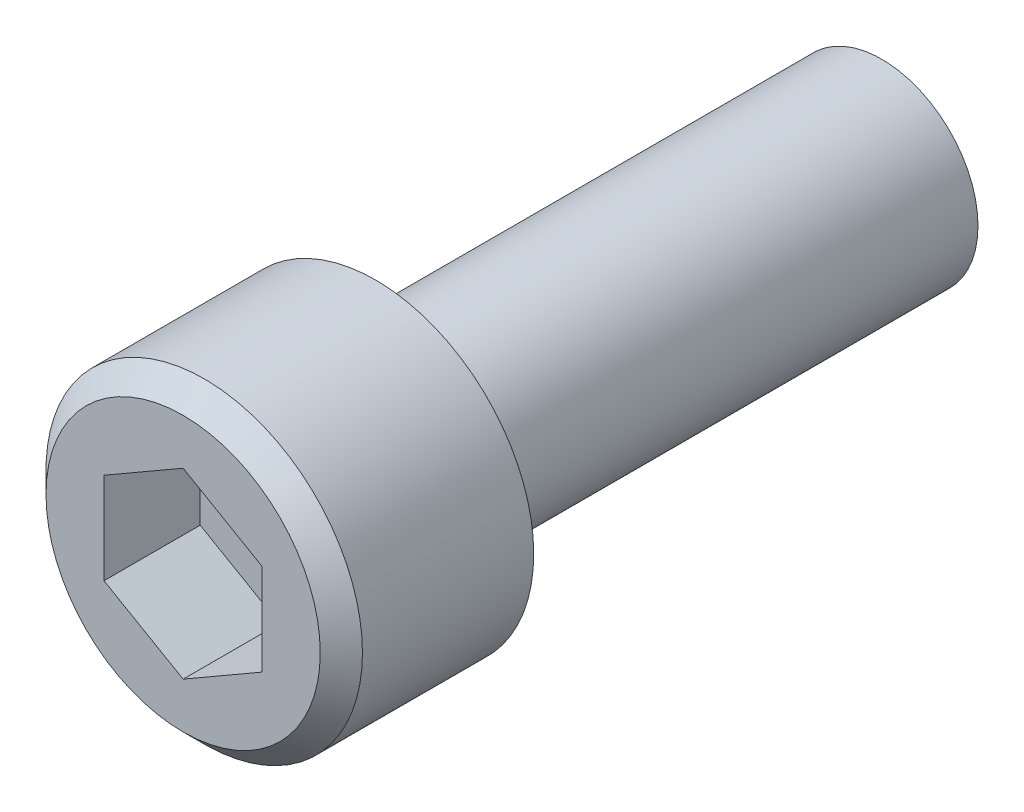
ISO-10303-21;
HEADER;
FILE_DESCRIPTION(('STEP AP214'),'2;1');
FILE_NAME('part.step','',(''),(''),'','','');
FILE_SCHEMA(('AUTOMOTIVE_DESIGN { 1 0 10303 214 1 1 1 1 }'));
ENDSEC;
DATA;
#1=APPLICATION_CONTEXT('core data for automotive mechanical design processes');
#2=APPLICATION_PROTOCOL_DEFINITION('international standard','automotive_design',2000,#1);
#3=PRODUCT_CONTEXT('',#1,'mechanical');
#4=PRODUCT('Part','Part','',(#3));
#5=PRODUCT_RELATED_PRODUCT_CATEGORY('part','',(#4));
#6=PRODUCT_DEFINITION_FORMATION('','',#4);
#7=PRODUCT_DEFINITION_CONTEXT('part definition',#1,'design');
#8=PRODUCT_DEFINITION('design','',#6,#7);
#9=PRODUCT_DEFINITION_SHAPE('','',#8);
#10=(LENGTH_UNIT() NAMED_UNIT(*) SI_UNIT(.MILLI.,.METRE.));
#11=(NAMED_UNIT(*) PLANE_ANGLE_UNIT() SI_UNIT($,.RADIAN.));
#12=(NAMED_UNIT(*) SI_UNIT($,.STERADIAN.) SOLID_ANGLE_UNIT());
#13=UNCERTAINTY_MEASURE_WITH_UNIT(LENGTH_MEASURE(1.E-05),#10,'distance_accuracy_value','');
#14=(GEOMETRIC_REPRESENTATION_CONTEXT(3) GLOBAL_UNCERTAINTY_ASSIGNED_CONTEXT((#13)) GLOBAL_UNIT_ASSIGNED_CONTEXT((#10,
#11,#12)) REPRESENTATION_CONTEXT('',''));
#15=CARTESIAN_POINT('',(0.,0.,0.));
#16=DIRECTION('',(0.,0.,1.));
#17=DIRECTION('',(1.,0.,0.));
#18=AXIS2_PLACEMENT_3D('',#15,#16,#17);
#19=CARTESIAN_POINT('',(0.,0.,12.7));
#20=DIRECTION('',(0.,0.,-1.));
#21=DIRECTION('',(-1.,0.,0.));
#22=AXIS2_PLACEMENT_3D('',#19,#20,#21);
#23=CYLINDRICAL_SURFACE('',#22,2.413);
#24=CARTESIAN_POINT('',(0.,0.,12.3444));
#25=DIRECTION('',(0.,0.,1.));
#26=DIRECTION('',(1.,0.,0.));
#27=AXIS2_PLACEMENT_3D('',#24,#25,#26);
#28=CIRCLE('',#27,2.413);
#29=CARTESIAN_POINT('',(2.413,0.,12.3444));
#30=VERTEX_POINT('',#29);
#31=EDGE_CURVE('E149',#30,#30,#28,.F.);
#32=ORIENTED_EDGE('',*,*,#31,.T.);
#33=EDGE_LOOP('',(#32));
#34=FACE_BOUND('',#33,.T.);
#35=CARTESIAN_POINT('',(0.,0.,0.));
#36=DIRECTION('',(0.,0.,1.));
#37=DIRECTION('',(1.,0.,0.));
#38=AXIS2_PLACEMENT_3D('',#35,#36,#37);
#39=CIRCLE('',#38,2.413);
#40=CARTESIAN_POINT('',(2.413,0.,0.));
#41=VERTEX_POINT('',#40);
#42=EDGE_CURVE('E143',#41,#41,#39,.T.);
#43=ORIENTED_EDGE('',*,*,#42,.T.);
#44=EDGE_LOOP('',(#43));
#45=FACE_BOUND('',#44,.T.);
#46=ADVANCED_FACE('F36',(#34,#45),#23,.T.);
#47=CARTESIAN_POINT('',(0.,0.,0.));
#48=DIRECTION('',(0.,0.,1.));
#49=DIRECTION('',(1.,0.,0.));
#50=AXIS2_PLACEMENT_3D('',#47,#48,#49);
#51=PLANE('',#50);
#52=ORIENTED_EDGE('',*,*,#42,.F.);
#53=EDGE_LOOP('',(#52));
#54=FACE_BOUND('',#53,.T.);
#55=ADVANCED_FACE('F167',(#54),#51,.F.);
#56=CARTESIAN_POINT('',(0.,0.,12.7));
#57=DIRECTION('',(0.,0.,1.));
#58=DIRECTION('',(1.,0.,0.));
#59=AXIS2_PLACEMENT_3D('',#56,#57,#58);
#60=PLANE('',#59);
#61=CARTESIAN_POINT('',(0.,0.,12.7));
#62=DIRECTION('',(0.,0.,1.));
#63=DIRECTION('',(1.,0.,0.));
#64=AXIS2_PLACEMENT_3D('',#61,#62,#63);
#65=CIRCLE('',#64,2.7686);
#66=CARTESIAN_POINT('',(2.7686,0.,12.7));
#67=VERTEX_POINT('',#66);
#68=EDGE_CURVE('E146',#67,#67,#65,.T.);
#69=ORIENTED_EDGE('',*,*,#68,.T.);
#70=EDGE_LOOP('',(#69));
#71=FACE_BOUND('',#70,.T.);
#72=CARTESIAN_POINT('',(0.,0.,12.7));
#73=DIRECTION('',(0.,0.,1.));
#74=DIRECTION('',(1.,0.,0.));
#75=AXIS2_PLACEMENT_3D('',#72,#73,#74);
#76=CIRCLE('',#75,3.96875);
#77=CARTESIAN_POINT('',(3.96875,0.,12.7));
#78=VERTEX_POINT('',#77);
#79=EDGE_CURVE('E134',#78,#78,#76,.T.);
#80=ORIENTED_EDGE('',*,*,#79,.F.);
#81=EDGE_LOOP('',(#80));
#82=FACE_BOUND('',#81,.T.);
#83=ADVANCED_FACE('F172',(#71,#82),#60,.F.);
#84=CARTESIAN_POINT('',(0.,0.,17.526));
#85=DIRECTION('',(0.,0.,-1.));
#86=DIRECTION('',(-1.,0.,0.));
#87=AXIS2_PLACEMENT_3D('',#84,#85,#86);
#88=CYLINDRICAL_SURFACE('',#87,3.96875);
#89=CARTESIAN_POINT('',(0.,0.,16.9968333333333));
#90=DIRECTION('',(0.,0.,1.));
#91=DIRECTION('',(1.,0.,0.));
#92=AXIS2_PLACEMENT_3D('',#89,#90,#91);
#93=CIRCLE('',#92,3.96875);
#94=CARTESIAN_POINT('',(3.96875,0.,16.9968333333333));
#95=VERTEX_POINT('',#94);
#96=EDGE_CURVE('E11',#95,#95,#93,.F.);
#97=ORIENTED_EDGE('',*,*,#96,.T.);
#98=EDGE_LOOP('',(#97));
#99=FACE_BOUND('',#98,.T.);
#100=ORIENTED_EDGE('',*,*,#79,.T.);
#101=EDGE_LOOP('',(#100));
#102=FACE_BOUND('',#101,.T.);
#103=ADVANCED_FACE('F187',(#99,#102),#88,.T.);
#104=CARTESIAN_POINT('',(0.,0.,17.526));
#105=DIRECTION('',(0.,0.,1.));
#106=DIRECTION('',(1.,0.,0.));
#107=AXIS2_PLACEMENT_3D('',#104,#105,#106);
#108=PLANE('',#107);
#109=CARTESIAN_POINT('',(0.,0.,17.526));
#110=DIRECTION('',(0.,0.,1.));
#111=DIRECTION('',(1.,0.,0.));
#112=AXIS2_PLACEMENT_3D('',#109,#110,#111);
#113=CIRCLE('',#112,3.43958333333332);
#114=CARTESIAN_POINT('',(3.43958333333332,0.,17.526));
#115=VERTEX_POINT('',#114);
#116=EDGE_CURVE('E43',#115,#115,#113,.T.);
#117=ORIENTED_EDGE('',*,*,#116,.T.);
#118=EDGE_LOOP('',(#117));
#119=FACE_BOUND('',#118,.T.);
#120=DIRECTION('',(-0.866025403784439,-0.5,0.));
#121=VECTOR('',#120,1.);
#122=CARTESIAN_POINT('',(0.,2.29135888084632,17.5260000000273));
#123=LINE('',#122,#121);
#124=CARTESIAN_POINT('',(0.,2.29135888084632,17.5260000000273));
#125=VERTEX_POINT('',#124);
#126=CARTESIAN_POINT('',(-1.984375,1.14567944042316,17.526));
#127=VERTEX_POINT('',#126);
#128=EDGE_CURVE('E50',#125,#127,#123,.T.);
#129=ORIENTED_EDGE('',*,*,#128,.F.);
#130=DIRECTION('',(0.866025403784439,-0.5,0.));
#131=VECTOR('',#130,1.);
#132=CARTESIAN_POINT('',(0.,2.29135888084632,17.5260000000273));
#133=LINE('',#132,#131);
#134=CARTESIAN_POINT('',(1.984375,1.14567944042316,17.5260000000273));
#135=VERTEX_POINT('',#134);
#136=EDGE_CURVE('E117',#125,#135,#133,.T.);
#137=ORIENTED_EDGE('',*,*,#136,.T.);
#138=DIRECTION('',(0.,-1.,0.));
#139=VECTOR('',#138,1.);
#140=CARTESIAN_POINT('',(1.984375,1.14567944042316,17.5260000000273));
#141=LINE('',#140,#139);
#142=CARTESIAN_POINT('',(1.984375,-1.14567944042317,17.5260000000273));
#143=VERTEX_POINT('',#142);
#144=EDGE_CURVE('E112',#135,#143,#141,.T.);
#145=ORIENTED_EDGE('',*,*,#144,.T.);
#146=DIRECTION('',(0.866025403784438,0.5,0.));
#147=VECTOR('',#146,1.);
#148=CARTESIAN_POINT('',(0.,-2.29135888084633,17.5260000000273));
#149=LINE('',#148,#147);
#150=CARTESIAN_POINT('',(0.,-2.29135888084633,17.5260000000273));
#151=VERTEX_POINT('',#150);
#152=EDGE_CURVE('E110',#151,#143,#149,.T.);
#153=ORIENTED_EDGE('',*,*,#152,.F.);
#154=DIRECTION('',(-0.866025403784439,0.5,0.));
#155=VECTOR('',#154,1.);
#156=CARTESIAN_POINT('',(0.,-2.29135888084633,17.5260000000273));
#157=LINE('',#156,#155);
#158=CARTESIAN_POINT('',(-1.984375,-1.14567944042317,17.5260000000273));
#159=VERTEX_POINT('',#158);
#160=EDGE_CURVE('E92',#151,#159,#157,.T.);
#161=ORIENTED_EDGE('',*,*,#160,.T.);
#162=DIRECTION('',(0.,-1.,0.));
#163=VECTOR('',#162,1.);
#164=CARTESIAN_POINT('',(-1.984375,1.14567944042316,17.5260000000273));
#165=LINE('',#164,#163);
#166=EDGE_CURVE('E103',#127,#159,#165,.T.);
#167=ORIENTED_EDGE('',*,*,#166,.F.);
#168=EDGE_LOOP('',(#129,#137,#145,#153,#161,#167));
#169=FACE_BOUND('',#168,.T.);
#170=ADVANCED_FACE('F107',(#119,#169),#108,.T.);
#171=CARTESIAN_POINT('',(0.,0.,12.3444));
#172=DIRECTION('',(0.,0.,1.));
#173=DIRECTION('',(1.,0.,0.));
#174=AXIS2_PLACEMENT_3D('',#171,#172,#173);
#175=TOROIDAL_SURFACE('',#174,2.7686,0.3556);
#176=ORIENTED_EDGE('',*,*,#31,.F.);
#177=EDGE_LOOP('',(#176));
#178=FACE_BOUND('',#177,.T.);
#179=ORIENTED_EDGE('',*,*,#68,.F.);
#180=EDGE_LOOP('',(#179));
#181=FACE_BOUND('',#180,.T.);
#182=ADVANCED_FACE('F178',(#178,#181),#175,.F.);
#183=CARTESIAN_POINT('',(0.,2.29135888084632,15.1130000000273));
#184=DIRECTION('',(-0.5,0.866025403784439,0.));
#185=DIRECTION('',(-0.866025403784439,-0.5,0.));
#186=AXIS2_PLACEMENT_3D('',#183,#184,#185);
#187=PLANE('',#186);
#188=ORIENTED_EDGE('',*,*,#128,.T.);
#189=DIRECTION('',(0.,0.,1.));
#190=VECTOR('',#189,1.);
#191=CARTESIAN_POINT('',(-1.984375,1.14567944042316,15.1130000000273));
#192=LINE('',#191,#190);
#193=CARTESIAN_POINT('',(-1.984375,1.14567944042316,15.1130000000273));
#194=VERTEX_POINT('',#193);
#195=EDGE_CURVE('E100',#194,#127,#192,.T.);
#196=ORIENTED_EDGE('',*,*,#195,.F.);
#197=DIRECTION('',(-0.866025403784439,-0.5,0.));
#198=VECTOR('',#197,1.);
#199=CARTESIAN_POINT('',(0.,2.29135888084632,15.1130000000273));
#200=LINE('',#199,#198);
#201=CARTESIAN_POINT('',(0.,2.29135888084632,15.1130000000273));
#202=VERTEX_POINT('',#201);
#203=EDGE_CURVE('E120',#202,#194,#200,.T.);
#204=ORIENTED_EDGE('',*,*,#203,.F.);
#205=DIRECTION('',(0.,0.,1.));
#206=VECTOR('',#205,1.);
#207=CARTESIAN_POINT('',(0.,2.29135888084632,15.1130000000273));
#208=LINE('',#207,#206);
#209=EDGE_CURVE('E57',#202,#125,#208,.T.);
#210=ORIENTED_EDGE('',*,*,#209,.T.);
#211=EDGE_LOOP('',(#188,#196,#204,#210));
#212=FACE_BOUND('',#211,.T.);
#213=ADVANCED_FACE('F181',(#212),#187,.F.);
#214=CARTESIAN_POINT('',(0.,2.29135888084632,15.1130000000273));
#215=DIRECTION('',(-0.5,-0.866025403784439,0.));
#216=DIRECTION('',(0.866025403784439,-0.5,0.));
#217=AXIS2_PLACEMENT_3D('',#214,#215,#216);
#218=PLANE('',#217);
#219=ORIENTED_EDGE('',*,*,#136,.F.);
#220=ORIENTED_EDGE('',*,*,#209,.F.);
#221=DIRECTION('',(0.866025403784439,-0.5,0.));
#222=VECTOR('',#221,1.);
#223=CARTESIAN_POINT('',(0.,2.29135888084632,15.1130000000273));
#224=LINE('',#223,#222);
#225=CARTESIAN_POINT('',(1.984375,1.14567944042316,15.1130000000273));
#226=VERTEX_POINT('',#225);
#227=EDGE_CURVE('E131',#202,#226,#224,.T.);
#228=ORIENTED_EDGE('',*,*,#227,.T.);
#229=DIRECTION('',(0.,0.,1.));
#230=VECTOR('',#229,1.);
#231=CARTESIAN_POINT('',(1.984375,1.14567944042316,15.1130000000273));
#232=LINE('',#231,#230);
#233=EDGE_CURVE('E135',#226,#135,#232,.T.);
#234=ORIENTED_EDGE('',*,*,#233,.T.);
#235=EDGE_LOOP('',(#219,#220,#228,#234));
#236=FACE_BOUND('',#235,.T.);
#237=ADVANCED_FACE('F201',(#236),#218,.T.);
#238=CARTESIAN_POINT('',(1.984375,1.14567944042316,15.1130000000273));
#239=DIRECTION('',(-1.,0.,0.));
#240=DIRECTION('',(0.,0.,1.));
#241=AXIS2_PLACEMENT_3D('',#238,#239,#240);
#242=PLANE('',#241);
#243=ORIENTED_EDGE('',*,*,#144,.F.);
#244=ORIENTED_EDGE('',*,*,#233,.F.);
#245=DIRECTION('',(0.,-1.,0.));
#246=VECTOR('',#245,1.);
#247=CARTESIAN_POINT('',(1.984375,1.14567944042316,15.1130000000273));
#248=LINE('',#247,#246);
#249=CARTESIAN_POINT('',(1.984375,-1.14567944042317,15.1130000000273));
#250=VERTEX_POINT('',#249);
#251=EDGE_CURVE('E129',#226,#250,#248,.T.);
#252=ORIENTED_EDGE('',*,*,#251,.T.);
#253=DIRECTION('',(0.,0.,1.));
#254=VECTOR('',#253,1.);
#255=CARTESIAN_POINT('',(1.984375,-1.14567944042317,15.1130000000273));
#256=LINE('',#255,#254);
#257=EDGE_CURVE('E137',#250,#143,#256,.T.);
#258=ORIENTED_EDGE('',*,*,#257,.T.);
#259=EDGE_LOOP('',(#243,#244,#252,#258));
#260=FACE_BOUND('',#259,.T.);
#261=ADVANCED_FACE('F209',(#260),#242,.T.);
#262=CARTESIAN_POINT('',(0.,-2.29135888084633,15.1130000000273));
#263=DIRECTION('',(0.5,-0.866025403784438,0.));
#264=DIRECTION('',(0.866025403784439,0.5,0.));
#265=AXIS2_PLACEMENT_3D('',#262,#263,#264);
#266=PLANE('',#265);
#267=ORIENTED_EDGE('',*,*,#152,.T.);
#268=ORIENTED_EDGE('',*,*,#257,.F.);
#269=DIRECTION('',(0.866025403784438,0.5,0.));
#270=VECTOR('',#269,1.);
#271=CARTESIAN_POINT('',(0.,-2.29135888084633,15.1130000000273));
#272=LINE('',#271,#270);
#273=CARTESIAN_POINT('',(0.,-2.29135888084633,15.1130000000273));
#274=VERTEX_POINT('',#273);
#275=EDGE_CURVE('E126',#274,#250,#272,.T.);
#276=ORIENTED_EDGE('',*,*,#275,.F.);
#277=DIRECTION('',(0.,0.,1.));
#278=VECTOR('',#277,1.);
#279=CARTESIAN_POINT('',(0.,-2.29135888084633,15.1130000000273));
#280=LINE('',#279,#278);
#281=EDGE_CURVE('E99',#274,#151,#280,.T.);
#282=ORIENTED_EDGE('',*,*,#281,.T.);
#283=EDGE_LOOP('',(#267,#268,#276,#282));
#284=FACE_BOUND('',#283,.T.);
#285=ADVANCED_FACE('F206',(#284),#266,.F.);
#286=CARTESIAN_POINT('',(0.,-2.29135888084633,15.1130000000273));
#287=DIRECTION('',(0.5,0.866025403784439,0.));
#288=DIRECTION('',(-0.866025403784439,0.5,0.));
#289=AXIS2_PLACEMENT_3D('',#286,#287,#288);
#290=PLANE('',#289);
#291=ORIENTED_EDGE('',*,*,#160,.F.);
#292=ORIENTED_EDGE('',*,*,#281,.F.);
#293=DIRECTION('',(-0.866025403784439,0.5,0.));
#294=VECTOR('',#293,1.);
#295=CARTESIAN_POINT('',(0.,-2.29135888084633,15.1130000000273));
#296=LINE('',#295,#294);
#297=CARTESIAN_POINT('',(-1.984375,-1.14567944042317,15.1130000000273));
#298=VERTEX_POINT('',#297);
#299=EDGE_CURVE('E95',#274,#298,#296,.T.);
#300=ORIENTED_EDGE('',*,*,#299,.T.);
#301=DIRECTION('',(0.,0.,1.));
#302=VECTOR('',#301,1.);
#303=CARTESIAN_POINT('',(-1.984375,-1.14567944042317,15.1130000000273));
#304=LINE('',#303,#302);
#305=EDGE_CURVE('E88',#298,#159,#304,.T.);
#306=ORIENTED_EDGE('',*,*,#305,.T.);
#307=EDGE_LOOP('',(#291,#292,#300,#306));
#308=FACE_BOUND('',#307,.T.);
#309=ADVANCED_FACE('F90',(#308),#290,.T.);
#310=CARTESIAN_POINT('',(-1.984375,1.14567944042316,15.1130000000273));
#311=DIRECTION('',(-1.,0.,0.));
#312=DIRECTION('',(0.,0.,1.));
#313=AXIS2_PLACEMENT_3D('',#310,#311,#312);
#314=PLANE('',#313);
#315=ORIENTED_EDGE('',*,*,#166,.T.);
#316=ORIENTED_EDGE('',*,*,#305,.F.);
#317=DIRECTION('',(0.,-1.,0.));
#318=VECTOR('',#317,1.);
#319=CARTESIAN_POINT('',(-1.984375,1.14567944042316,15.1130000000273));
#320=LINE('',#319,#318);
#321=EDGE_CURVE('E123',#194,#298,#320,.T.);
#322=ORIENTED_EDGE('',*,*,#321,.F.);
#323=ORIENTED_EDGE('',*,*,#195,.T.);
#324=EDGE_LOOP('',(#315,#316,#322,#323));
#325=FACE_BOUND('',#324,.T.);
#326=ADVANCED_FACE('F104',(#325),#314,.F.);
#327=CARTESIAN_POINT('',(0.,2.29135888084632,15.1130000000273));
#328=DIRECTION('',(0.,0.,1.));
#329=DIRECTION('',(1.,0.,0.));
#330=AXIS2_PLACEMENT_3D('',#327,#328,#329);
#331=PLANE('',#330);
#332=ORIENTED_EDGE('',*,*,#203,.T.);
#333=ORIENTED_EDGE('',*,*,#321,.T.);
#334=ORIENTED_EDGE('',*,*,#299,.F.);
#335=ORIENTED_EDGE('',*,*,#275,.T.);
#336=ORIENTED_EDGE('',*,*,#251,.F.);
#337=ORIENTED_EDGE('',*,*,#227,.F.);
#338=EDGE_LOOP('',(#332,#333,#334,#335,#336,#337));
#339=FACE_BOUND('',#338,.T.);
#340=ADVANCED_FACE('F157',(#339),#331,.T.);
#341=CARTESIAN_POINT('',(0.,0.,17.526));
#342=DIRECTION('',(0.,0.,-1.));
#343=DIRECTION('',(-1.,0.,0.));
#344=AXIS2_PLACEMENT_3D('',#341,#342,#343);
#345=CONICAL_SURFACE('',#344,3.43958333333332,0.785398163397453);
#346=ORIENTED_EDGE('',*,*,#96,.F.);
#347=EDGE_LOOP('',(#346));
#348=FACE_BOUND('',#347,.T.);
#349=ORIENTED_EDGE('',*,*,#116,.F.);
#350=EDGE_LOOP('',(#349));
#351=FACE_BOUND('',#350,.T.);
#352=ADVANCED_FACE('F155',(#348,#351),#345,.T.);
#353=CLOSED_SHELL('',(#46,#55,#83,#103,#170,#182,#213,#237,#261,#285,#309,#326,#340,#352));
#354=MANIFOLD_SOLID_BREP('B2',#353);
#355=ADVANCED_BREP_SHAPE_REPRESENTATION('',(#18,#354),#14);
#356=SHAPE_DEFINITION_REPRESENTATION(#9,#355);
ENDSEC;
END-ISO-10303-21;
